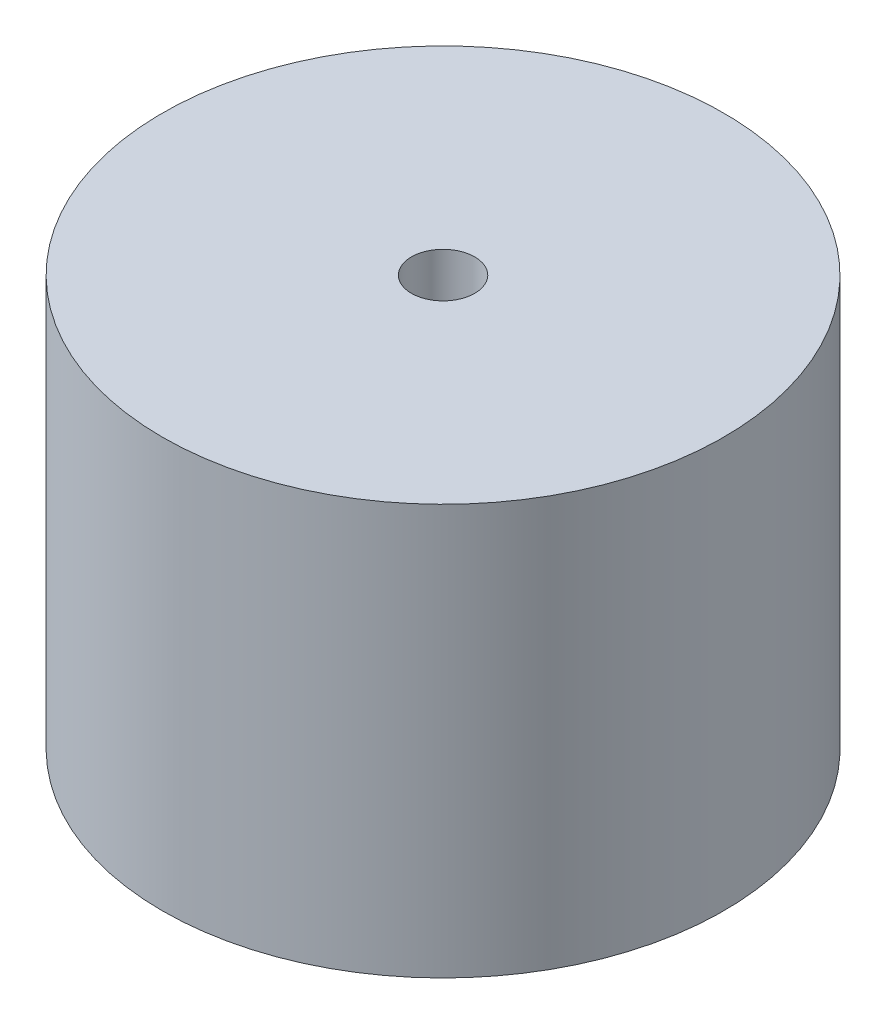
from build123d import *

# Parameters (mm, degrees)
SKETCH1_R           = 26
SKETCH1_R_2         = 2.929746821
BOSS_EXTRUDE1_DEPTH = 38


with BuildPart() as part:
    # Sketch1 → Boss-Extrude1 (new body)
    with BuildSketch(Plane(origin=(0, 0, 0), x_dir=(1, 0, 0), z_dir=(0, 1, 0))):
        with Locations(Location((0, 0, 0), (0, 0, 270))):
            Circle(SKETCH1_R)
        with Locations(Location((0, 0, 0), (0, 0, 270))):
            Circle(SKETCH1_R_2, mode=Mode.SUBTRACT)
    extrude(amount=BOSS_EXTRUDE1_DEPTH)


solid = part.part
